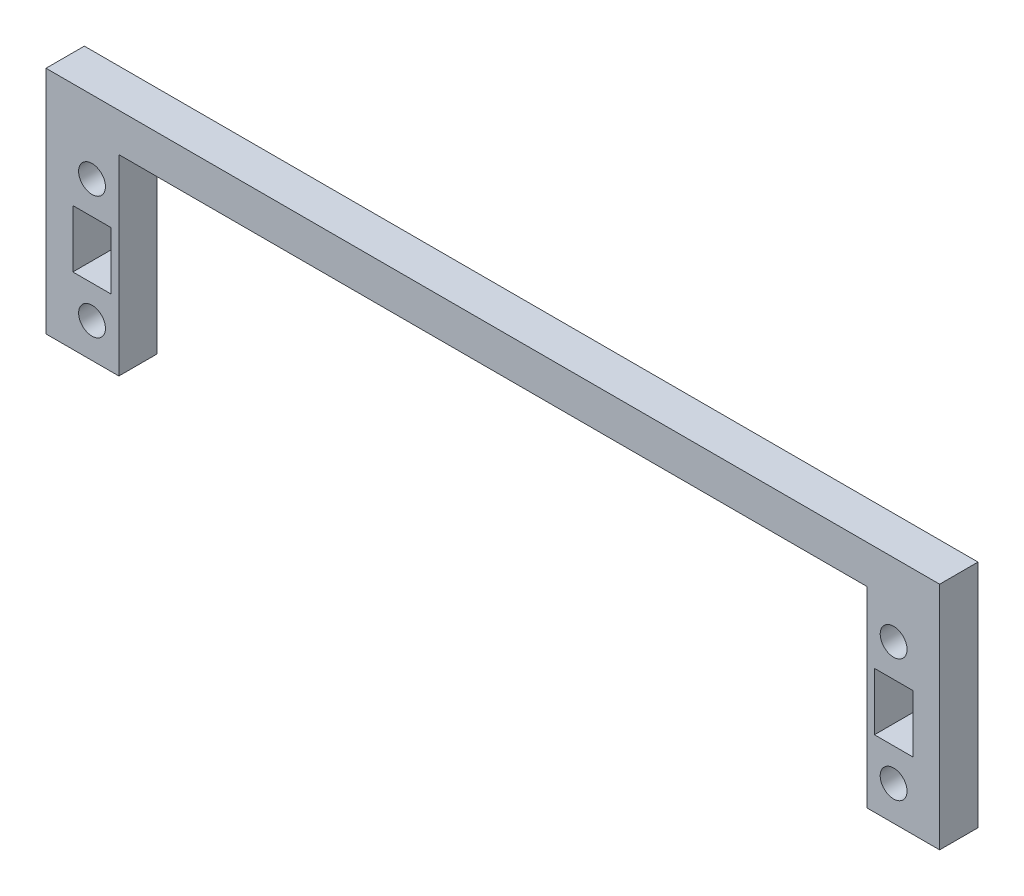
from build123d import *

# Parameters (mm, degrees)
SKETCH2_W             = 19
SKETCH2_H             = 50
SKETCH2_R             = 3.5
SKETCH2_W_2           = 10
SKETCH2_H_2           = 15
BOSS_EXTRUDE1_DEPTH   = 10
BOSS_EXTRUDE1_2_DEPTH = 10
SKETCH3_W             = 195
SKETCH3_H             = 10
SKETCH3_W_2           = 19
BOSS_EXTRUDE2_DEPTH   = 10


with BuildPart() as part:
    # Sketch2 → Boss-Extrude1 (new body)
    with BuildSketch(Plane.XY):
        with Locations((-107, 0)):
            Rectangle(SKETCH2_W, SKETCH2_H)
        with Locations((-104.5, 16)):
            Circle(SKETCH2_R, mode=Mode.SUBTRACT)
        with Locations((-104.5, -16)):
            Circle(SKETCH2_R, mode=Mode.SUBTRACT)
        with Locations((-104.5, 0)):
            Rectangle(SKETCH2_W_2, SKETCH2_H_2, mode=Mode.SUBTRACT)
    extrude(amount=BOSS_EXTRUDE1_DEPTH)



with BuildPart() as body_2:
    # Sketch2 → Boss-Extrude1 2 (new body)
    with BuildSketch(Plane.XY):
        with Locations((107, 0)):
            Rectangle(SKETCH2_W, SKETCH2_H)
        with Locations((104.5, -16)):
            Circle(SKETCH2_R, mode=Mode.SUBTRACT)
        with Locations((104.5, 16)):
            Circle(SKETCH2_R, mode=Mode.SUBTRACT)
        with Locations((104.5, 0)):
            Rectangle(SKETCH2_W_2, SKETCH2_H_2, mode=Mode.SUBTRACT)
    extrude(amount=BOSS_EXTRUDE1_2_DEPTH)


with BuildPart() as part_1:
    add(part.part)

    add(body_2.part)  # Boss-Extrude2 merges body 2
    # Sketch3 → Boss-Extrude2 (add)
    with BuildSketch(Plane(origin=(0, 25, 0), x_dir=(1, 0, 0), z_dir=(0, 1, 0))):
        with Locations((0, -5)):
            Rectangle(SKETCH3_W, SKETCH3_H)
        with Locations((-107, -5)):
            Rectangle(SKETCH3_W_2, SKETCH3_H)
        with Locations((107, -5)):
            Rectangle(SKETCH3_W_2, SKETCH3_H)
    extrude(amount=BOSS_EXTRUDE2_DEPTH)


solid = part_1.part
